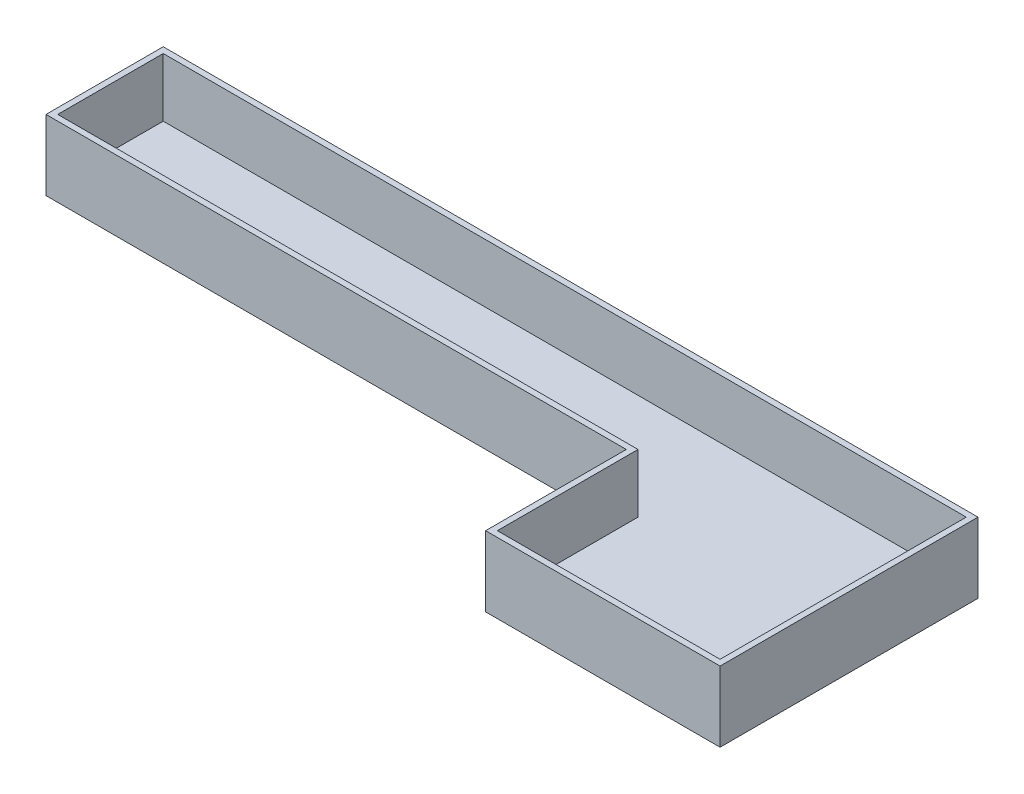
from build123d import *

# Parameters (mm, degrees)
BOSS_EXTRUDE1_DEPTH = 76.2
CUT_EXTRUDE1_DEPTH  = 127


with BuildPart() as part:
    # Sketch1 → Boss-Extrude1 (new, symmetric)
    with BuildSketch(Plane(origin=(0, 0, 0), x_dir=(1, 0, 0), z_dir=(0, 1, 0))):
        Polygon((0, 0), (0, 254), (1765.3, 254), (1765.3, -304.8), (1257.3, -304.8), (1257.3, 0), align=None)
    extrude(amount=BOSS_EXTRUDE1_DEPTH, both=True)

    # Sketch2 → Cut-Extrude1 (cut)
    with BuildSketch(Plane(origin=(0, 76.2, 0), x_dir=(1, 0, 0), z_dir=(0, 1, 0))):
        Polygon((12.7, 12.7), (12.7, 241.3), (1752.6, 241.3), (1752.6, -292.1), (1270, -292.1), (1270, 12.7), align=None)
    extrude(amount=-CUT_EXTRUDE1_DEPTH, mode=Mode.SUBTRACT)


solid = part.part
